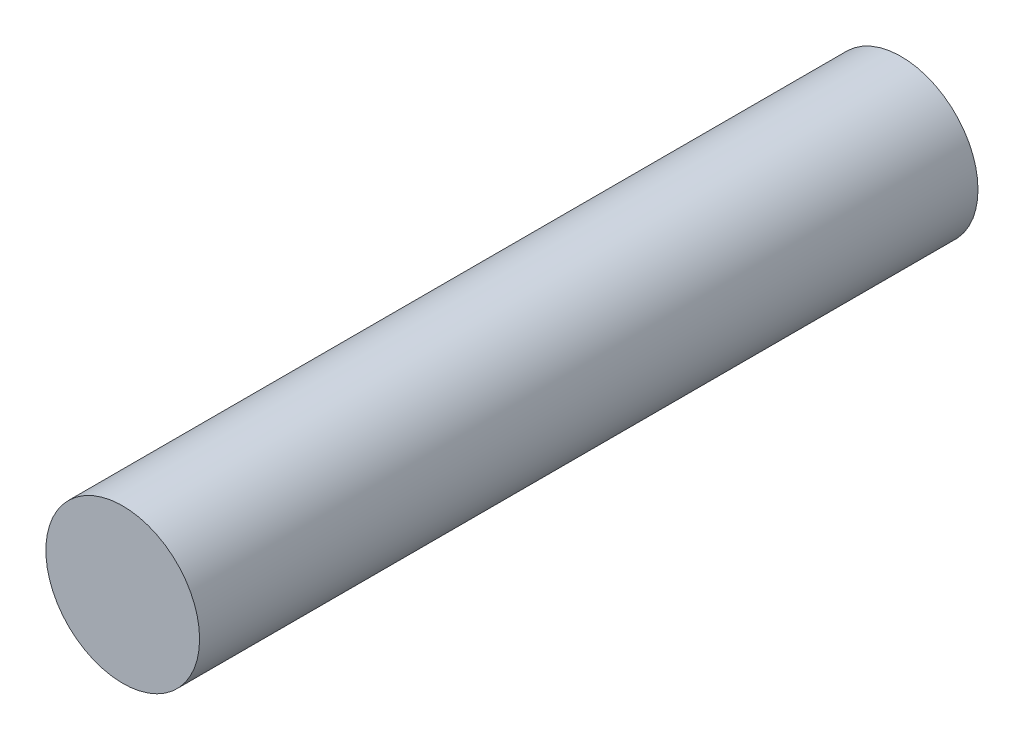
ISO-10303-21;
HEADER;
FILE_DESCRIPTION(('STEP AP214'),'2;1');
FILE_NAME('part.step','',(''),(''),'','','');
FILE_SCHEMA(('AUTOMOTIVE_DESIGN { 1 0 10303 214 1 1 1 1 }'));
ENDSEC;
DATA;
#1=APPLICATION_CONTEXT('core data for automotive mechanical design processes');
#2=APPLICATION_PROTOCOL_DEFINITION('international standard','automotive_design',2000,#1);
#3=PRODUCT_CONTEXT('',#1,'mechanical');
#4=PRODUCT('Part','Part','',(#3));
#5=PRODUCT_RELATED_PRODUCT_CATEGORY('part','',(#4));
#6=PRODUCT_DEFINITION_FORMATION('','',#4);
#7=PRODUCT_DEFINITION_CONTEXT('part definition',#1,'design');
#8=PRODUCT_DEFINITION('design','',#6,#7);
#9=PRODUCT_DEFINITION_SHAPE('','',#8);
#10=(LENGTH_UNIT() NAMED_UNIT(*) SI_UNIT(.MILLI.,.METRE.));
#11=(NAMED_UNIT(*) PLANE_ANGLE_UNIT() SI_UNIT($,.RADIAN.));
#12=(NAMED_UNIT(*) SI_UNIT($,.STERADIAN.) SOLID_ANGLE_UNIT());
#13=UNCERTAINTY_MEASURE_WITH_UNIT(LENGTH_MEASURE(1.E-05),#10,'distance_accuracy_value','');
#14=(GEOMETRIC_REPRESENTATION_CONTEXT(3) GLOBAL_UNCERTAINTY_ASSIGNED_CONTEXT((#13)) GLOBAL_UNIT_ASSIGNED_CONTEXT((#10,
#11,#12)) REPRESENTATION_CONTEXT('',''));
#15=CARTESIAN_POINT('',(0.,0.,0.));
#16=DIRECTION('',(0.,0.,1.));
#17=DIRECTION('',(1.,0.,0.));
#18=AXIS2_PLACEMENT_3D('',#15,#16,#17);
#19=CARTESIAN_POINT('',(0.,0.,40.));
#20=DIRECTION('',(0.,0.,-1.));
#21=DIRECTION('',(-1.,0.,0.));
#22=AXIS2_PLACEMENT_3D('',#19,#20,#21);
#23=CYLINDRICAL_SURFACE('',#22,3.95);
#24=CARTESIAN_POINT('',(0.,0.,40.));
#25=DIRECTION('',(0.,0.,1.));
#26=DIRECTION('',(1.,0.,0.));
#27=AXIS2_PLACEMENT_3D('',#24,#25,#26);
#28=CIRCLE('',#27,3.95);
#29=CARTESIAN_POINT('',(3.95,0.,40.));
#30=VERTEX_POINT('',#29);
#31=EDGE_CURVE('E10',#30,#30,#28,.T.);
#32=ORIENTED_EDGE('',*,*,#31,.F.);
#33=EDGE_LOOP('',(#32));
#34=FACE_BOUND('',#33,.T.);
#35=CARTESIAN_POINT('',(0.,0.,0.));
#36=DIRECTION('',(0.,0.,1.));
#37=DIRECTION('',(1.,0.,0.));
#38=AXIS2_PLACEMENT_3D('',#35,#36,#37);
#39=CIRCLE('',#38,3.95);
#40=CARTESIAN_POINT('',(3.95,0.,0.));
#41=VERTEX_POINT('',#40);
#42=EDGE_CURVE('E38',#41,#41,#39,.T.);
#43=ORIENTED_EDGE('',*,*,#42,.T.);
#44=EDGE_LOOP('',(#43));
#45=FACE_BOUND('',#44,.T.);
#46=ADVANCED_FACE('F35',(#34,#45),#23,.T.);
#47=CARTESIAN_POINT('',(0.,0.,40.));
#48=DIRECTION('',(0.,0.,1.));
#49=DIRECTION('',(1.,0.,0.));
#50=AXIS2_PLACEMENT_3D('',#47,#48,#49);
#51=PLANE('',#50);
#52=ORIENTED_EDGE('',*,*,#31,.T.);
#53=EDGE_LOOP('',(#52));
#54=FACE_BOUND('',#53,.T.);
#55=ADVANCED_FACE('F50',(#54),#51,.T.);
#56=CARTESIAN_POINT('',(0.,0.,0.));
#57=DIRECTION('',(0.,0.,1.));
#58=DIRECTION('',(1.,0.,0.));
#59=AXIS2_PLACEMENT_3D('',#56,#57,#58);
#60=PLANE('',#59);
#61=ORIENTED_EDGE('',*,*,#42,.F.);
#62=EDGE_LOOP('',(#61));
#63=FACE_BOUND('',#62,.T.);
#64=ADVANCED_FACE('F48',(#63),#60,.F.);
#65=CLOSED_SHELL('',(#46,#55,#64));
#66=MANIFOLD_SOLID_BREP('B2',#65);
#67=ADVANCED_BREP_SHAPE_REPRESENTATION('',(#18,#66),#14);
#68=SHAPE_DEFINITION_REPRESENTATION(#9,#67);
ENDSEC;
END-ISO-10303-21;
